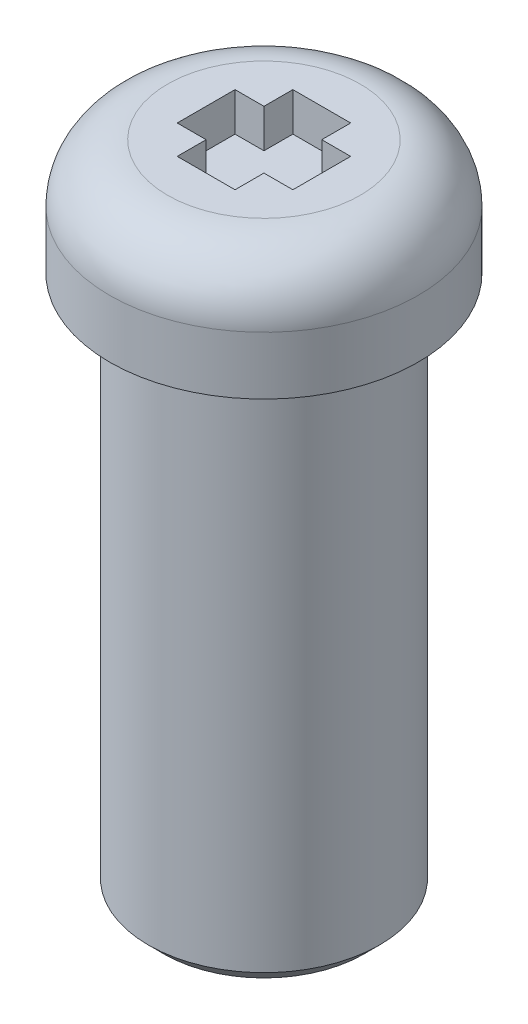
from build123d import *

# Parameters (mm, degrees)
SKETCH2_W               = 1.5
SKETCH2_H               = 3
CUT_EXTRUDE_THIN2_DEPTH = 1
CIRPATTERN1_COUNT       = 2
CIRPATTERN1_ANGLE       = 90
SKETCH3_R               = 3
BOSS_EXTRUDE1_DEPTH     = 14
FILLET1_R               = 0.4572
CHAMFER1_SIZE           = 0.4064


with BuildPart() as part:
    # Sketch1 → Base-Revolve (revolve)
    with BuildSketch(Plane.XY, mode=Mode.PRIVATE) as base_revolve_sk:
        with BuildLine():
            Line((4, 0), (0, 0))
            Line((0, 0), (0, 3))
            Line((0, 3), (2.5, 3))
            ThreePointArc((2.5, 3), (3.560660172, 2.560660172), (4, 1.5))
            Line((4, 1.5), (4, 0))
        make_face()
    revolve(base_revolve_sk.sketch.rotate(Axis((0, 11.592517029, 0), (0, -1, 0)), 90), axis=Axis((0, 11.592517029, 0), (0, -1, 0)))

    # Sketch2 → Cut-Extrude-Thin2 (cut)
    with BuildSketch(Plane(origin=(0, 3, 0), x_dir=(-1, 0, 0), z_dir=(0, 1, 0))):
        Rectangle(SKETCH2_W, SKETCH2_H)
    cut_extrude_thin2 = extrude(amount=-CUT_EXTRUDE_THIN2_DEPTH, mode=Mode.SUBTRACT)

    # CirPattern1: Cut-Extrude-Thin2 ×2 about axis
    cirpattern1_axis = Axis((0, 0, 0), (0, 1, 0))
    for i in range(1, CIRPATTERN1_COUNT):
        add(cut_extrude_thin2.rotate(cirpattern1_axis, i * CIRPATTERN1_ANGLE / (CIRPATTERN1_COUNT - 1)), mode=Mode.SUBTRACT)

    # Sketch3 → Boss-Extrude1 (add)
    with BuildSketch(Plane.XZ):
        with Locations(Location((0, 0, 0), (0, 0, 90))):
            Circle(SKETCH3_R)
    extrude(amount=BOSS_EXTRUDE1_DEPTH)

    # Fillet1
    fillet1_edges = [part.edges().sort_by_distance(p)[0] for p in [
        (0, 0, -3),
    ]]
    fillet(fillet1_edges, radius=FILLET1_R)

    # Chamfer1
    chamfer1_edges = [part.edges().sort_by_distance(p)[0] for p in [
        (0, -14, -3),
    ]]
    chamfer(chamfer1_edges, length=CHAMFER1_SIZE)


solid = part.part
